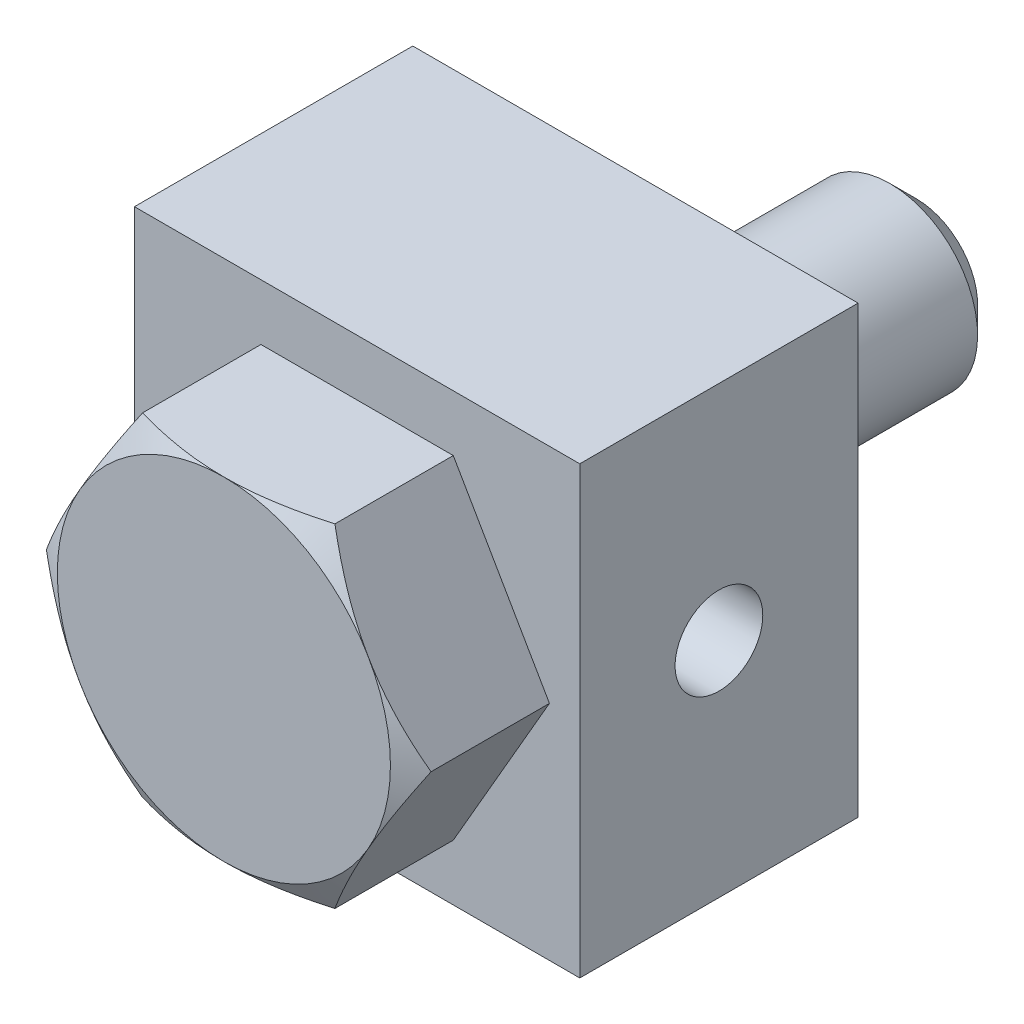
ISO-10303-21;
HEADER;
FILE_DESCRIPTION(('STEP AP214'),'2;1');
FILE_NAME('part.step','',(''),(''),'','','');
FILE_SCHEMA(('AUTOMOTIVE_DESIGN { 1 0 10303 214 1 1 1 1 }'));
ENDSEC;
DATA;
#1=APPLICATION_CONTEXT('core data for automotive mechanical design processes');
#2=APPLICATION_PROTOCOL_DEFINITION('international standard','automotive_design',2000,#1);
#3=PRODUCT_CONTEXT('',#1,'mechanical');
#4=PRODUCT('Part','Part','',(#3));
#5=PRODUCT_RELATED_PRODUCT_CATEGORY('part','',(#4));
#6=PRODUCT_DEFINITION_FORMATION('','',#4);
#7=PRODUCT_DEFINITION_CONTEXT('part definition',#1,'design');
#8=PRODUCT_DEFINITION('design','',#6,#7);
#9=PRODUCT_DEFINITION_SHAPE('','',#8);
#10=(LENGTH_UNIT() NAMED_UNIT(*) SI_UNIT(.MILLI.,.METRE.));
#11=(NAMED_UNIT(*) PLANE_ANGLE_UNIT() SI_UNIT($,.RADIAN.));
#12=(NAMED_UNIT(*) SI_UNIT($,.STERADIAN.) SOLID_ANGLE_UNIT());
#13=UNCERTAINTY_MEASURE_WITH_UNIT(LENGTH_MEASURE(1.E-05),#10,'distance_accuracy_value','');
#14=(GEOMETRIC_REPRESENTATION_CONTEXT(3) GLOBAL_UNCERTAINTY_ASSIGNED_CONTEXT((#13)) GLOBAL_UNIT_ASSIGNED_CONTEXT((#10,
#11,#12)) REPRESENTATION_CONTEXT('',''));
#15=CARTESIAN_POINT('',(0.,0.,0.));
#16=DIRECTION('',(0.,0.,1.));
#17=DIRECTION('',(1.,0.,0.));
#18=AXIS2_PLACEMENT_3D('',#15,#16,#17);
#19=CARTESIAN_POINT('',(12.7,12.7,16.891));
#20=DIRECTION('',(0.,0.,-1.));
#21=DIRECTION('',(0.,-1.,0.));
#22=AXIS2_PLACEMENT_3D('',#19,#20,#21);
#23=PLANE('',#22);
#24=DIRECTION('',(-1.,0.,0.));
#25=VECTOR('',#24,1.);
#26=CARTESIAN_POINT('',(0.,12.7,16.891));
#27=LINE('',#26,#25);
#28=CARTESIAN_POINT('',(12.7,12.7,16.891));
#29=VERTEX_POINT('',#28);
#30=CARTESIAN_POINT('',(-12.7,12.7,16.891));
#31=VERTEX_POINT('',#30);
#32=EDGE_CURVE('E259',#29,#31,#27,.T.);
#33=ORIENTED_EDGE('',*,*,#32,.T.);
#34=DIRECTION('',(0.,1.,0.));
#35=VECTOR('',#34,1.);
#36=CARTESIAN_POINT('',(-12.7,0.,16.891));
#37=LINE('',#36,#35);
#38=CARTESIAN_POINT('',(-12.7,-12.7,16.891));
#39=VERTEX_POINT('',#38);
#40=EDGE_CURVE('E268',#39,#31,#37,.T.);
#41=ORIENTED_EDGE('',*,*,#40,.F.);
#42=DIRECTION('',(-1.,0.,0.));
#43=VECTOR('',#42,1.);
#44=CARTESIAN_POINT('',(0.,-12.7,16.891));
#45=LINE('',#44,#43);
#46=CARTESIAN_POINT('',(12.7,-12.7,16.891));
#47=VERTEX_POINT('',#46);
#48=EDGE_CURVE('E313',#47,#39,#45,.T.);
#49=ORIENTED_EDGE('',*,*,#48,.F.);
#50=DIRECTION('',(0.,1.,0.));
#51=VECTOR('',#50,1.);
#52=CARTESIAN_POINT('',(12.7,0.,16.891));
#53=LINE('',#52,#51);
#54=EDGE_CURVE('E280',#47,#29,#53,.T.);
#55=ORIENTED_EDGE('',*,*,#54,.T.);
#56=EDGE_LOOP('',(#33,#41,#49,#55));
#57=FACE_BOUND('',#56,.T.);
#58=DIRECTION('',(-0.5,-0.866025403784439,0.));
#59=VECTOR('',#58,1.);
#60=CARTESIAN_POINT('',(-5.4848275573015,9.5,16.891));
#61=LINE('',#60,#59);
#62=CARTESIAN_POINT('',(-5.4848275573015,9.5,16.891));
#63=VERTEX_POINT('',#62);
#64=CARTESIAN_POINT('',(-10.969655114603,0.,16.891));
#65=VERTEX_POINT('',#64);
#66=EDGE_CURVE('E503',#63,#65,#61,.T.);
#67=ORIENTED_EDGE('',*,*,#66,.F.);
#68=DIRECTION('',(-1.,0.,0.));
#69=VECTOR('',#68,1.);
#70=CARTESIAN_POINT('',(5.48482755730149,9.5,16.891));
#71=LINE('',#70,#69);
#72=CARTESIAN_POINT('',(5.48482755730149,9.5,16.891));
#73=VERTEX_POINT('',#72);
#74=EDGE_CURVE('E517',#73,#63,#71,.T.);
#75=ORIENTED_EDGE('',*,*,#74,.F.);
#76=DIRECTION('',(-0.5,0.866025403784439,0.));
#77=VECTOR('',#76,1.);
#78=CARTESIAN_POINT('',(10.969655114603,0.,16.891));
#79=LINE('',#78,#77);
#80=CARTESIAN_POINT('',(10.969655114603,0.,16.891));
#81=VERTEX_POINT('',#80);
#82=EDGE_CURVE('E514',#81,#73,#79,.T.);
#83=ORIENTED_EDGE('',*,*,#82,.F.);
#84=DIRECTION('',(0.5,0.866025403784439,0.));
#85=VECTOR('',#84,1.);
#86=CARTESIAN_POINT('',(5.4848275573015,-9.5,16.891));
#87=LINE('',#86,#85);
#88=CARTESIAN_POINT('',(5.48482755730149,-9.5,16.891));
#89=VERTEX_POINT('',#88);
#90=EDGE_CURVE('E512',#89,#81,#87,.T.);
#91=ORIENTED_EDGE('',*,*,#90,.F.);
#92=DIRECTION('',(1.,0.,0.));
#93=VECTOR('',#92,1.);
#94=CARTESIAN_POINT('',(-5.48482755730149,-9.5,16.891));
#95=LINE('',#94,#93);
#96=CARTESIAN_POINT('',(-5.48482755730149,-9.5,16.891));
#97=VERTEX_POINT('',#96);
#98=EDGE_CURVE('E509',#97,#89,#95,.T.);
#99=ORIENTED_EDGE('',*,*,#98,.F.);
#100=DIRECTION('',(0.5,-0.866025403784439,0.));
#101=VECTOR('',#100,1.);
#102=CARTESIAN_POINT('',(-10.969655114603,0.,16.891));
#103=LINE('',#102,#101);
#104=EDGE_CURVE('E506',#65,#97,#103,.T.);
#105=ORIENTED_EDGE('',*,*,#104,.F.);
#106=EDGE_LOOP('',(#67,#75,#83,#91,#99,#105));
#107=FACE_BOUND('',#106,.T.);
#108=ADVANCED_FACE('F14',(#57,#107),#23,.F.);
#109=CARTESIAN_POINT('',(6.3747904,-6.3747904,0.));
#110=DIRECTION('',(0.,0.,1.));
#111=DIRECTION('',(0.,1.,0.));
#112=AXIS2_PLACEMENT_3D('',#109,#110,#111);
#113=PLANE('',#112);
#114=CARTESIAN_POINT('',(0.,0.,0.));
#115=DIRECTION('',(0.,0.,1.));
#116=DIRECTION('',(0.,1.,0.));
#117=AXIS2_PLACEMENT_3D('',#114,#115,#116);
#118=CIRCLE('',#117,4.99999);
#119=CARTESIAN_POINT('',(0.,4.99999,0.));
#120=VERTEX_POINT('',#119);
#121=EDGE_CURVE('E134',#120,#120,#118,.T.);
#122=ORIENTED_EDGE('',*,*,#121,.T.);
#123=EDGE_LOOP('',(#122));
#124=FACE_BOUND('',#123,.T.);
#125=CARTESIAN_POINT('',(0.,0.,0.));
#126=DIRECTION('',(0.,0.,1.));
#127=DIRECTION('',(1.,0.,0.));
#128=AXIS2_PLACEMENT_3D('',#125,#126,#127);
#129=CIRCLE('',#128,6.2992);
#130=CARTESIAN_POINT('',(6.2992,0.,0.));
#131=VERTEX_POINT('',#130);
#132=EDGE_CURVE('E302',#131,#131,#129,.F.);
#133=ORIENTED_EDGE('',*,*,#132,.T.);
#134=EDGE_LOOP('',(#133));
#135=FACE_BOUND('',#134,.T.);
#136=ADVANCED_FACE('F212',(#124,#135),#113,.F.);
#137=CARTESIAN_POINT('',(-12.7,-12.7,1.016));
#138=DIRECTION('',(1.,0.,0.));
#139=DIRECTION('',(0.,1.,0.));
#140=AXIS2_PLACEMENT_3D('',#137,#138,#139);
#141=PLANE('',#140);
#142=CARTESIAN_POINT('',(-12.7,0.,8.9535));
#143=DIRECTION('',(1.,0.,0.));
#144=DIRECTION('',(0.,0.,-1.));
#145=AXIS2_PLACEMENT_3D('',#142,#143,#144);
#146=CIRCLE('',#145,2.5);
#147=CARTESIAN_POINT('',(-12.7,0.,6.4535));
#148=VERTEX_POINT('',#147);
#149=EDGE_CURVE('E331',#148,#148,#146,.T.);
#150=ORIENTED_EDGE('',*,*,#149,.T.);
#151=EDGE_LOOP('',(#150));
#152=FACE_BOUND('',#151,.T.);
#153=DIRECTION('',(0.,0.,1.));
#154=VECTOR('',#153,1.);
#155=CARTESIAN_POINT('',(-12.7,-12.7,8.9535));
#156=LINE('',#155,#154);
#157=CARTESIAN_POINT('',(-12.7,-12.7,1.016));
#158=VERTEX_POINT('',#157);
#159=EDGE_CURVE('E305',#158,#39,#156,.T.);
#160=ORIENTED_EDGE('',*,*,#159,.T.);
#161=ORIENTED_EDGE('',*,*,#40,.T.);
#162=DIRECTION('',(0.,0.,-1.));
#163=VECTOR('',#162,1.);
#164=CARTESIAN_POINT('',(-12.7,12.7,8.9535));
#165=LINE('',#164,#163);
#166=CARTESIAN_POINT('',(-12.7,12.7,1.016));
#167=VERTEX_POINT('',#166);
#168=EDGE_CURVE('E258',#31,#167,#165,.T.);
#169=ORIENTED_EDGE('',*,*,#168,.T.);
#170=DIRECTION('',(0.,1.,0.));
#171=VECTOR('',#170,1.);
#172=CARTESIAN_POINT('',(-12.7,0.,1.016));
#173=LINE('',#172,#171);
#174=EDGE_CURVE('E271',#158,#167,#173,.T.);
#175=ORIENTED_EDGE('',*,*,#174,.F.);
#176=EDGE_LOOP('',(#160,#161,#169,#175));
#177=FACE_BOUND('',#176,.T.);
#178=ADVANCED_FACE('F220',(#152,#177),#141,.F.);
#179=CARTESIAN_POINT('',(0.,0.,0.));
#180=DIRECTION('',(0.,0.,1.));
#181=DIRECTION('',(1.,0.,0.));
#182=AXIS2_PLACEMENT_3D('',#179,#180,#181);
#183=CYLINDRICAL_SURFACE('',#182,6.2992);
#184=CARTESIAN_POINT('',(0.,0.,1.016));
#185=DIRECTION('',(0.,0.,1.));
#186=DIRECTION('',(1.,0.,0.));
#187=AXIS2_PLACEMENT_3D('',#184,#185,#186);
#188=CIRCLE('',#187,6.2992);
#189=CARTESIAN_POINT('',(6.2992,0.,1.016));
#190=VERTEX_POINT('',#189);
#191=EDGE_CURVE('E277',#190,#190,#188,.T.);
#192=ORIENTED_EDGE('',*,*,#191,.F.);
#193=EDGE_LOOP('',(#192));
#194=FACE_BOUND('',#193,.T.);
#195=ORIENTED_EDGE('',*,*,#132,.F.);
#196=EDGE_LOOP('',(#195));
#197=FACE_BOUND('',#196,.T.);
#198=ADVANCED_FACE('F253',(#194,#197),#183,.T.);
#199=CARTESIAN_POINT('',(12.7,-12.7,1.016));
#200=DIRECTION('',(0.,1.,0.));
#201=DIRECTION('',(-1.,0.,0.));
#202=AXIS2_PLACEMENT_3D('',#199,#200,#201);
#203=PLANE('',#202);
#204=DIRECTION('',(0.,0.,1.));
#205=VECTOR('',#204,1.);
#206=CARTESIAN_POINT('',(12.7,-12.7,8.9535));
#207=LINE('',#206,#205);
#208=CARTESIAN_POINT('',(12.7,-12.7,1.016));
#209=VERTEX_POINT('',#208);
#210=EDGE_CURVE('E278',#209,#47,#207,.T.);
#211=ORIENTED_EDGE('',*,*,#210,.T.);
#212=ORIENTED_EDGE('',*,*,#48,.T.);
#213=ORIENTED_EDGE('',*,*,#159,.F.);
#214=DIRECTION('',(-1.,0.,0.));
#215=VECTOR('',#214,1.);
#216=CARTESIAN_POINT('',(0.,-12.7,1.016));
#217=LINE('',#216,#215);
#218=EDGE_CURVE('E266',#209,#158,#217,.T.);
#219=ORIENTED_EDGE('',*,*,#218,.F.);
#220=EDGE_LOOP('',(#211,#212,#213,#219));
#221=FACE_BOUND('',#220,.T.);
#222=ADVANCED_FACE('F247',(#221),#203,.F.);
#223=CARTESIAN_POINT('',(-12.7,12.7,1.016));
#224=DIRECTION('',(0.,-1.,0.));
#225=DIRECTION('',(1.,0.,0.));
#226=AXIS2_PLACEMENT_3D('',#223,#224,#225);
#227=PLANE('',#226);
#228=ORIENTED_EDGE('',*,*,#168,.F.);
#229=ORIENTED_EDGE('',*,*,#32,.F.);
#230=DIRECTION('',(0.,0.,-1.));
#231=VECTOR('',#230,1.);
#232=CARTESIAN_POINT('',(12.7,12.7,8.9535));
#233=LINE('',#232,#231);
#234=CARTESIAN_POINT('',(12.7,12.7,1.016));
#235=VERTEX_POINT('',#234);
#236=EDGE_CURVE('E282',#29,#235,#233,.T.);
#237=ORIENTED_EDGE('',*,*,#236,.T.);
#238=DIRECTION('',(1.,0.,0.));
#239=VECTOR('',#238,1.);
#240=CARTESIAN_POINT('',(0.,12.7,1.016));
#241=LINE('',#240,#239);
#242=EDGE_CURVE('E262',#167,#235,#241,.T.);
#243=ORIENTED_EDGE('',*,*,#242,.F.);
#244=EDGE_LOOP('',(#228,#229,#237,#243));
#245=FACE_BOUND('',#244,.T.);
#246=ADVANCED_FACE('F240',(#245),#227,.F.);
#247=CARTESIAN_POINT('',(12.7,12.7,1.016));
#248=DIRECTION('',(0.,0.,-1.));
#249=DIRECTION('',(0.,-1.,0.));
#250=AXIS2_PLACEMENT_3D('',#247,#248,#249);
#251=PLANE('',#250);
#252=ORIENTED_EDGE('',*,*,#191,.T.);
#253=EDGE_LOOP('',(#252));
#254=FACE_BOUND('',#253,.T.);
#255=ORIENTED_EDGE('',*,*,#174,.T.);
#256=ORIENTED_EDGE('',*,*,#242,.T.);
#257=DIRECTION('',(0.,-1.,0.));
#258=VECTOR('',#257,1.);
#259=CARTESIAN_POINT('',(12.7,0.,1.016));
#260=LINE('',#259,#258);
#261=EDGE_CURVE('E284',#235,#209,#260,.T.);
#262=ORIENTED_EDGE('',*,*,#261,.T.);
#263=ORIENTED_EDGE('',*,*,#218,.T.);
#264=EDGE_LOOP('',(#255,#256,#262,#263));
#265=FACE_BOUND('',#264,.T.);
#266=ADVANCED_FACE('F229',(#254,#265),#251,.T.);
#267=CARTESIAN_POINT('',(12.7,12.7,1.016));
#268=DIRECTION('',(-1.,0.,0.));
#269=DIRECTION('',(0.,-1.,0.));
#270=AXIS2_PLACEMENT_3D('',#267,#268,#269);
#271=PLANE('',#270);
#272=CARTESIAN_POINT('',(12.7,0.,8.9535));
#273=DIRECTION('',(1.,0.,0.));
#274=DIRECTION('',(0.,0.,-1.));
#275=AXIS2_PLACEMENT_3D('',#272,#273,#274);
#276=CIRCLE('',#275,2.5);
#277=CARTESIAN_POINT('',(12.7,0.,6.4535));
#278=VERTEX_POINT('',#277);
#279=EDGE_CURVE('E334',#278,#278,#276,.T.);
#280=ORIENTED_EDGE('',*,*,#279,.F.);
#281=EDGE_LOOP('',(#280));
#282=FACE_BOUND('',#281,.T.);
#283=ORIENTED_EDGE('',*,*,#236,.F.);
#284=ORIENTED_EDGE('',*,*,#54,.F.);
#285=ORIENTED_EDGE('',*,*,#210,.F.);
#286=ORIENTED_EDGE('',*,*,#261,.F.);
#287=EDGE_LOOP('',(#283,#284,#285,#286));
#288=FACE_BOUND('',#287,.T.);
#289=ADVANCED_FACE('F215',(#282,#288),#271,.F.);
#290=CARTESIAN_POINT('',(0.,0.,-13.716));
#291=DIRECTION('',(0.,0.,1.));
#292=DIRECTION('',(1.,0.,0.));
#293=AXIS2_PLACEMENT_3D('',#290,#291,#292);
#294=CYLINDRICAL_SURFACE('',#293,4.99999);
#295=CARTESIAN_POINT('',(0.,0.,-13.5));
#296=DIRECTION('',(0.,0.,-1.));
#297=DIRECTION('',(0.,1.,0.));
#298=AXIS2_PLACEMENT_3D('',#295,#296,#297);
#299=CIRCLE('',#298,4.99999);
#300=CARTESIAN_POINT('',(0.,4.99999,-13.5));
#301=VERTEX_POINT('',#300);
#302=EDGE_CURVE('E9',#301,#301,#299,.F.);
#303=ORIENTED_EDGE('',*,*,#302,.T.);
#304=EDGE_LOOP('',(#303));
#305=FACE_BOUND('',#304,.T.);
#306=ORIENTED_EDGE('',*,*,#121,.F.);
#307=EDGE_LOOP('',(#306));
#308=FACE_BOUND('',#307,.T.);
#309=ADVANCED_FACE('F223',(#305,#308),#294,.T.);
#310=CARTESIAN_POINT('',(-5.4848275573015,9.5,24.491));
#311=DIRECTION('',(0.866025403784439,-0.5,0.));
#312=DIRECTION('',(0.5,0.866025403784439,0.));
#313=AXIS2_PLACEMENT_3D('',#310,#311,#312);
#314=PLANE('',#313);
#315=DIRECTION('',(0.,0.,-1.));
#316=VECTOR('',#315,1.);
#317=CARTESIAN_POINT('',(-10.969655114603,0.,24.491));
#318=LINE('',#317,#316);
#319=CARTESIAN_POINT('',(-10.969655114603,0.,23.6424942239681));
#320=VERTEX_POINT('',#319);
#321=EDGE_CURVE('E286',#320,#65,#318,.T.);
#322=ORIENTED_EDGE('',*,*,#321,.F.);
#323=CARTESIAN_POINT('',(-10.9697705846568,-0.000200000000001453,23.6424275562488));
#324=CARTESIAN_POINT('',(-10.8492020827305,0.208630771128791,23.7120265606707));
#325=CARTESIAN_POINT('',(-10.7281840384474,0.418240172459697,23.7784666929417));
#326=CARTESIAN_POINT('',(-10.4851774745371,0.839139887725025,23.9041527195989));
#327=CARTESIAN_POINT('',(-10.3631886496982,1.05043073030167,23.9633962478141));
#328=CARTESIAN_POINT('',(-9.995256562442,1.68770779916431,24.1291854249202));
#329=CARTESIAN_POINT('',(-9.74786083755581,2.11620976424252,24.2234855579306));
#330=CARTESIAN_POINT('',(-9.37764446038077,2.75744333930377,24.3340612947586));
#331=CARTESIAN_POINT('',(-9.25592985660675,2.96825921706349,24.3655601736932));
#332=CARTESIAN_POINT('',(-9.01193711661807,3.39086703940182,24.418381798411));
#333=CARTESIAN_POINT('',(-8.88965896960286,3.60265900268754,24.4397043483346));
#334=CARTESIAN_POINT('',(-8.6448987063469,4.0265962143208,24.4716269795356));
#335=CARTESIAN_POINT('',(-8.5224170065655,4.23874074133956,24.4822398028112));
#336=CARTESIAN_POINT('',(-8.27734047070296,4.6632257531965,24.492517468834));
#337=CARTESIAN_POINT('',(-8.1547456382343,4.87556623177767,24.4921826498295));
#338=CARTESIAN_POINT('',(-7.92555157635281,5.27254199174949,24.4813266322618));
#339=CARTESIAN_POINT('',(-7.81893617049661,5.45720529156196,24.4721297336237));
#340=CARTESIAN_POINT('',(-7.60595470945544,5.82610000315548,24.4456346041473));
#341=CARTESIAN_POINT('',(-7.49958867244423,6.01033138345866,24.4283358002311));
#342=CARTESIAN_POINT('',(-7.1809027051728,6.56231167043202,24.3646955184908));
#343=CARTESIAN_POINT('',(-6.96914687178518,6.92908353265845,24.3066180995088));
#344=CARTESIAN_POINT('',(-6.54338898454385,7.66651782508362,24.1614239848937));
#345=CARTESIAN_POINT('',(-6.329441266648,8.03708614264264,24.0736918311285));
#346=CARTESIAN_POINT('',(-5.90473630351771,8.77269671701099,23.8745762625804));
#347=CARTESIAN_POINT('',(-5.69397361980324,9.13774839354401,23.7632396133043));
#348=CARTESIAN_POINT('',(-5.48471208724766,9.5002,23.6424275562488));
#349=B_SPLINE_CURVE_WITH_KNOTS('',3,(#323,#324,#325,#326,#327,#328,#329,#330,#331,#332,#333,
#334,#335,#336,#337,#338,#339,#340,#341,#342,#343,#344,#345,#346,#347,#348),.UNSPECIFIED.,.F.,
.F.,(4,2,2,2,2,2,2,2,2,2,2,2,4),(0.,0.752880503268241,1.50600787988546,3.01546870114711,
3.7516733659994,4.48789219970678,5.2232340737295,5.95855322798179,6.59868084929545,
7.23885375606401,8.52010929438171,9.82978009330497,11.1368800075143),.UNSPECIFIED.);
#350=CARTESIAN_POINT('',(-8.22724133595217,4.75,24.491));
#351=VERTEX_POINT('',#350);
#352=EDGE_CURVE('E144',#320,#351,#349,.T.);
#353=ORIENTED_EDGE('',*,*,#352,.T.);
#354=CARTESIAN_POINT('',(-5.4848275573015,9.5,23.6424942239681));
#355=VERTEX_POINT('',#354);
#356=EDGE_CURVE('E154',#351,#355,#349,.T.);
#357=ORIENTED_EDGE('',*,*,#356,.T.);
#358=DIRECTION('',(0.,0.,-1.));
#359=VECTOR('',#358,1.);
#360=CARTESIAN_POINT('',(-5.4848275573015,9.5,24.491));
#361=LINE('',#360,#359);
#362=EDGE_CURVE('E520',#355,#63,#361,.T.);
#363=ORIENTED_EDGE('',*,*,#362,.T.);
#364=ORIENTED_EDGE('',*,*,#66,.T.);
#365=EDGE_LOOP('',(#322,#353,#357,#363,#364));
#366=FACE_BOUND('',#365,.T.);
#367=ADVANCED_FACE('F237',(#366),#314,.F.);
#368=CARTESIAN_POINT('',(-10.969655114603,0.,24.491));
#369=DIRECTION('',(0.866025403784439,0.5,0.));
#370=DIRECTION('',(-0.5,0.866025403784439,0.));
#371=AXIS2_PLACEMENT_3D('',#368,#369,#370);
#372=PLANE('',#371);
#373=DIRECTION('',(0.,0.,-1.));
#374=VECTOR('',#373,1.);
#375=CARTESIAN_POINT('',(-5.48482755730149,-9.5,24.491));
#376=LINE('',#375,#374);
#377=CARTESIAN_POINT('',(-5.48482755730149,-9.5,23.6424942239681));
#378=VERTEX_POINT('',#377);
#379=EDGE_CURVE('E526',#378,#97,#376,.T.);
#380=ORIENTED_EDGE('',*,*,#379,.F.);
#381=CARTESIAN_POINT('',(-5.48471208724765,-9.5002,23.6424275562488));
#382=CARTESIAN_POINT('',(-5.60528058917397,-9.29136922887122,23.7120265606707));
#383=CARTESIAN_POINT('',(-5.72629863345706,-9.08175982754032,23.7784666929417));
#384=CARTESIAN_POINT('',(-5.96930519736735,-8.660860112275,23.9041527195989));
#385=CARTESIAN_POINT('',(-6.09129402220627,-8.44956926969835,23.9633962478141));
#386=CARTESIAN_POINT('',(-6.45922610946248,-7.81229220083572,24.1291854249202));
#387=CARTESIAN_POINT('',(-6.70662183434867,-7.38379023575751,24.2234855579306));
#388=CARTESIAN_POINT('',(-7.07683821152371,-6.74255666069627,24.3340612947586));
#389=CARTESIAN_POINT('',(-7.19855281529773,-6.53174078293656,24.3655601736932));
#390=CARTESIAN_POINT('',(-7.4425455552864,-6.10913296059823,24.418381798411));
#391=CARTESIAN_POINT('',(-7.56482370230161,-5.89734099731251,24.4397043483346));
#392=CARTESIAN_POINT('',(-7.80958396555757,-5.47340378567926,24.4716269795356));
#393=CARTESIAN_POINT('',(-7.93206566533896,-5.26125925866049,24.4822398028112));
#394=CARTESIAN_POINT('',(-8.17714220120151,-4.83677424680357,24.492517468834));
#395=CARTESIAN_POINT('',(-8.29973703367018,-4.6244337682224,24.4921826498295));
#396=CARTESIAN_POINT('',(-8.52893109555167,-4.22745800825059,24.4813266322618));
#397=CARTESIAN_POINT('',(-8.63554650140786,-4.04279470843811,24.4721297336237));
#398=CARTESIAN_POINT('',(-8.84852796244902,-3.67389999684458,24.4456346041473));
#399=CARTESIAN_POINT('',(-8.95489399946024,-3.4896686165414,24.428335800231));
#400=CARTESIAN_POINT('',(-9.27357996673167,-2.93768832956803,24.3646955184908));
#401=CARTESIAN_POINT('',(-9.48533580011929,-2.5709164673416,24.3066180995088));
#402=CARTESIAN_POINT('',(-9.91109368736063,-1.83348217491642,24.1614239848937));
#403=CARTESIAN_POINT('',(-10.1250414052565,-1.4629138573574,24.0736918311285));
#404=CARTESIAN_POINT('',(-10.5497463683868,-0.72730328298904,23.8745762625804));
#405=CARTESIAN_POINT('',(-10.7605090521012,-0.36225160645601,23.7632396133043));
#406=CARTESIAN_POINT('',(-10.9697705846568,0.000199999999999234,23.6424275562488));
#407=B_SPLINE_CURVE_WITH_KNOTS('',3,(#381,#382,#383,#384,#385,#386,#387,#388,#389,#390,#391,
#392,#393,#394,#395,#396,#397,#398,#399,#400,#401,#402,#403,#404,#405,#406),.UNSPECIFIED.,.F.,
.F.,(4,2,2,2,2,2,2,2,2,2,2,2,4),(0.,0.752880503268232,1.50600787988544,3.01546870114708,
3.75167336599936,4.48789219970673,5.22323407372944,5.95855322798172,6.59868084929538,
7.23885375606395,8.52010929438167,9.82978009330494,11.1368800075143),.UNSPECIFIED.);
#408=CARTESIAN_POINT('',(-8.22724133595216,-4.75,24.491));
#409=VERTEX_POINT('',#408);
#410=EDGE_CURVE('E120',#378,#409,#407,.T.);
#411=ORIENTED_EDGE('',*,*,#410,.T.);
#412=EDGE_CURVE('E37',#409,#320,#407,.T.);
#413=ORIENTED_EDGE('',*,*,#412,.T.);
#414=ORIENTED_EDGE('',*,*,#321,.T.);
#415=ORIENTED_EDGE('',*,*,#104,.T.);
#416=EDGE_LOOP('',(#380,#411,#413,#414,#415));
#417=FACE_BOUND('',#416,.T.);
#418=ADVANCED_FACE('F464',(#417),#372,.F.);
#419=CARTESIAN_POINT('',(-5.48482755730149,-9.5,24.491));
#420=DIRECTION('',(0.,1.,0.));
#421=DIRECTION('',(0.,0.,1.));
#422=AXIS2_PLACEMENT_3D('',#419,#420,#421);
#423=PLANE('',#422);
#424=DIRECTION('',(0.,0.,-1.));
#425=VECTOR('',#424,1.);
#426=CARTESIAN_POINT('',(5.4848275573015,-9.5,24.491));
#427=LINE('',#426,#425);
#428=CARTESIAN_POINT('',(5.4848275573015,-9.5,23.6424942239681));
#429=VERTEX_POINT('',#428);
#430=EDGE_CURVE('E525',#429,#89,#427,.T.);
#431=ORIENTED_EDGE('',*,*,#430,.F.);
#432=CARTESIAN_POINT('',(-14.7524780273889,-9.5,19.8452532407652));
#433=CARTESIAN_POINT('',(-14.5449439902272,-9.5,19.9459905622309));
#434=CARTESIAN_POINT('',(-14.3371669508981,-9.5,20.0462270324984));
#435=CARTESIAN_POINT('',(-13.9210761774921,-9.5,20.2455848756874));
#436=CARTESIAN_POINT('',(-13.7127624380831,-9.5,20.3447062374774));
#437=CARTESIAN_POINT('',(-13.0868849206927,-9.5,20.6402535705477));
#438=CARTESIAN_POINT('',(-12.6684459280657,-9.5,20.8348330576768));
#439=CARTESIAN_POINT('',(-11.82650642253,-9.5,21.2189386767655));
#440=CARTESIAN_POINT('',(-11.4029907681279,-9.5,21.4084316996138));
#441=CARTESIAN_POINT('',(-10.5525986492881,-9.5,21.7796924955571));
#442=CARTESIAN_POINT('',(-10.1257223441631,-9.5,21.9614606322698));
#443=CARTESIAN_POINT('',(-9.25405557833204,-9.5,22.3209497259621));
#444=CARTESIAN_POINT('',(-8.809132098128,-9.5,22.4983499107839));
#445=CARTESIAN_POINT('',(-7.91408812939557,-9.5,22.8397715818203));
#446=CARTESIAN_POINT('',(-7.46396706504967,-9.5,23.0037915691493));
#447=CARTESIAN_POINT('',(-6.55864256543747,-9.5,23.3141604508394));
#448=CARTESIAN_POINT('',(-6.1034514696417,-9.5,23.460544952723));
#449=CARTESIAN_POINT('',(-5.18655588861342,-9.5,23.7309603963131));
#450=CARTESIAN_POINT('',(-4.7248534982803,-9.5,23.854998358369));
#451=CARTESIAN_POINT('',(-3.79717375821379,-9.5,24.0741093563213));
#452=CARTESIAN_POINT('',(-3.33123486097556,-9.5,24.1693408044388));
#453=CARTESIAN_POINT('',(-2.62806774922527,-9.5,24.2864727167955));
#454=CARTESIAN_POINT('',(-2.39295175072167,-9.5,24.3212323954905));
#455=CARTESIAN_POINT('',(-1.92154445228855,-9.5,24.3814986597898));
#456=CARTESIAN_POINT('',(-1.68525326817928,-9.5,24.4070061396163));
#457=CARTESIAN_POINT('',(-1.21490723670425,-9.5,24.4479389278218));
#458=CARTESIAN_POINT('',(-0.980863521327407,-9.5,24.4634916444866));
#459=CARTESIAN_POINT('',(-0.512328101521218,-9.5,24.4846849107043));
#460=CARTESIAN_POINT('',(-0.277836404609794,-9.5,24.4903256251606));
#461=CARTESIAN_POINT('',(0.191175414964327,-9.5,24.4915602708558));
#462=CARTESIAN_POINT('',(0.425695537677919,-9.5,24.487154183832));
#463=CARTESIAN_POINT('',(0.894341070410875,-9.5,24.4684031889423));
#464=CARTESIAN_POINT('',(1.12846646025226,-9.5,24.4540577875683));
#465=CARTESIAN_POINT('',(1.69056071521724,-9.5,24.4079894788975));
#466=CARTESIAN_POINT('',(2.01815386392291,-9.5,24.3715828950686));
#467=CARTESIAN_POINT('',(2.6709061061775,-9.5,24.281292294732));
#468=CARTESIAN_POINT('',(2.99606486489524,-9.5,24.2274059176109));
#469=CARTESIAN_POINT('',(3.967520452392,-9.5,24.0423846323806));
#470=CARTESIAN_POINT('',(4.60943284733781,-9.5,23.8879213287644));
#471=CARTESIAN_POINT('',(5.56925757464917,-9.5,23.6201011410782));
#472=CARTESIAN_POINT('',(5.89214970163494,-9.5,23.5235647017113));
#473=CARTESIAN_POINT('',(6.53479798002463,-9.5,23.3204713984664));
#474=CARTESIAN_POINT('',(6.85455411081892,-9.5,23.2139144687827));
#475=CARTESIAN_POINT('',(7.49103073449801,-9.5,22.992489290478));
#476=CARTESIAN_POINT('',(7.80775219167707,-9.5,22.8776237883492));
#477=CARTESIAN_POINT('',(8.43857175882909,-9.5,22.6409323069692));
#478=CARTESIAN_POINT('',(8.75266989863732,-9.5,22.5191064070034));
#479=CARTESIAN_POINT('',(9.49009378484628,-9.5,22.2251837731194));
#480=CARTESIAN_POINT('',(9.91244509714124,-9.5,22.0506469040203));
#481=CARTESIAN_POINT('',(10.7535764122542,-9.5,21.693145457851));
#482=CARTESIAN_POINT('',(11.1723561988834,-9.5,21.5101803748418));
#483=CARTESIAN_POINT('',(12.0070039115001,-9.5,21.1374989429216));
#484=CARTESIAN_POINT('',(12.4228711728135,-9.5,20.9477811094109));
#485=CARTESIAN_POINT('',(13.252083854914,-9.5,20.5629474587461));
#486=CARTESIAN_POINT('',(13.6654293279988,-9.5,20.3678317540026));
#487=CARTESIAN_POINT('',(14.4904611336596,-9.5,19.972991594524));
#488=CARTESIAN_POINT('',(14.9021451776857,-9.5,19.7732623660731));
#489=CARTESIAN_POINT('',(15.7237369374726,-9.5,19.3701839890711));
#490=CARTESIAN_POINT('',(16.1336446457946,-9.5,19.1668348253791));
#491=CARTESIAN_POINT('',(16.9519029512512,-9.5,18.757159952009));
#492=CARTESIAN_POINT('',(17.3602537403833,-9.5,18.5508346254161));
#493=CARTESIAN_POINT('',(18.1756742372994,-9.5,18.1356664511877));
#494=CARTESIAN_POINT('',(18.5827439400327,-9.5,17.9268235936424));
#495=CARTESIAN_POINT('',(19.7346259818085,-9.5,17.3320693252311));
#496=CARTESIAN_POINT('',(20.4781477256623,-9.5,16.9436584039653));
#497=CARTESIAN_POINT('',(21.9624121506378,-9.5,16.1615126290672));
#498=CARTESIAN_POINT('',(22.7031547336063,-9.5,15.7677775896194));
#499=CARTESIAN_POINT('',(24.1806235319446,-9.5,14.9772078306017));
#500=CARTESIAN_POINT('',(24.917355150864,-9.5,14.5803832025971));
#501=CARTESIAN_POINT('',(26.0211396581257,-9.5,13.9827721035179));
#502=CARTESIAN_POINT('',(26.3888391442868,-9.5,13.7831781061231));
#503=CARTESIAN_POINT('',(27.1238498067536,-9.5,13.3832777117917));
#504=CARTESIAN_POINT('',(27.4911609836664,-9.5,13.1829713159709));
#505=CARTESIAN_POINT('',(27.8582999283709,-9.5,12.9823496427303));
#506=B_SPLINE_CURVE_WITH_KNOTS('',3,(#432,#433,#434,#435,#436,#437,#438,#439,#440,#441,#442,
#443,#444,#445,#446,#447,#448,#449,#450,#451,#452,#453,#454,#455,#456,#457,#458,#459,#460,#461,
#462,#463,#464,#465,#466,#467,#468,#469,#470,#471,#472,#473,#474,#475,#476,#477,#478,#479,#480,
#481,#482,#483,#484,#485,#486,#487,#488,#489,#490,#491,#492,#493,#494,#495,#496,#497,#498,#499,
#500,#501,#502,#503,#504,#505),.UNSPECIFIED.,.F.,.F.,(4,2,2,2,2,2,2,2,2,2,2,2,2,2,2,2,2,2,2,2,2,
2,2,2,2,2,2,2,2,2,2,2,2,2,2,2,4),(0.,0.692072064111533,1.38415103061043,2.76851276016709,
4.16037848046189,5.55217861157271,6.9889701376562,8.42592239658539,9.85992289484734,
11.2934721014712,12.7189883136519,13.4318495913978,14.1446419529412,14.8481187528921,
15.5515838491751,16.2550502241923,16.9585515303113,17.9468232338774,18.9352284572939,
20.9131299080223,21.9240882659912,22.9350532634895,23.9456855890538,24.9563064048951,
26.3271662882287,27.698108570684,29.0693541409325,30.440571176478,31.8132769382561,
33.185988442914,34.5585248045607,35.9310665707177,38.4476166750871,40.9642548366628,
43.4746603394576,44.7297956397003,45.984928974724),.UNSPECIFIED.);
#507=CARTESIAN_POINT('',(0.,-9.5,24.491));
#508=VERTEX_POINT('',#507);
#509=EDGE_CURVE('E116',#429,#508,#506,.F.);
#510=ORIENTED_EDGE('',*,*,#509,.T.);
#511=EDGE_CURVE('E29',#508,#378,#506,.F.);
#512=ORIENTED_EDGE('',*,*,#511,.T.);
#513=ORIENTED_EDGE('',*,*,#379,.T.);
#514=ORIENTED_EDGE('',*,*,#98,.T.);
#515=EDGE_LOOP('',(#431,#510,#512,#513,#514));
#516=FACE_BOUND('',#515,.T.);
#517=ADVANCED_FACE('F471',(#516),#423,.F.);
#518=CARTESIAN_POINT('',(5.4848275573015,-9.5,24.491));
#519=DIRECTION('',(-0.866025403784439,0.5,0.));
#520=DIRECTION('',(-0.5,-0.866025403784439,0.));
#521=AXIS2_PLACEMENT_3D('',#518,#519,#520);
#522=PLANE('',#521);
#523=DIRECTION('',(0.,0.,-1.));
#524=VECTOR('',#523,1.);
#525=CARTESIAN_POINT('',(10.969655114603,0.,24.491));
#526=LINE('',#525,#524);
#527=CARTESIAN_POINT('',(10.969655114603,0.,23.6424942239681));
#528=VERTEX_POINT('',#527);
#529=EDGE_CURVE('E142',#528,#81,#526,.T.);
#530=ORIENTED_EDGE('',*,*,#529,.F.);
#531=CARTESIAN_POINT('',(10.9697705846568,0.000200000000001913,23.6424275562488));
#532=CARTESIAN_POINT('',(10.8492020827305,-0.208630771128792,23.7120265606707));
#533=CARTESIAN_POINT('',(10.7281840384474,-0.418240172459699,23.7784666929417));
#534=CARTESIAN_POINT('',(10.4851774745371,-0.839139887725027,23.9041527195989));
#535=CARTESIAN_POINT('',(10.3631886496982,-1.05043073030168,23.9633962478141));
#536=CARTESIAN_POINT('',(9.995256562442,-1.68770779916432,24.1291854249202));
#537=CARTESIAN_POINT('',(9.74786083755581,-2.11620976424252,24.2234855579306));
#538=CARTESIAN_POINT('',(9.37764446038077,-2.75744333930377,24.3340612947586));
#539=CARTESIAN_POINT('',(9.25592985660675,-2.96825921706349,24.3655601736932));
#540=CARTESIAN_POINT('',(9.01193711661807,-3.39086703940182,24.418381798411));
#541=CARTESIAN_POINT('',(8.88965896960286,-3.60265900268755,24.4397043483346));
#542=CARTESIAN_POINT('',(8.6448987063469,-4.0265962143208,24.4716269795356));
#543=CARTESIAN_POINT('',(8.5224170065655,-4.23874074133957,24.4822398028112));
#544=CARTESIAN_POINT('',(8.27734047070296,-4.66322575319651,24.492517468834));
#545=CARTESIAN_POINT('',(8.1547456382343,-4.87556623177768,24.4921826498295));
#546=CARTESIAN_POINT('',(7.92555157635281,-5.2725419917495,24.4813266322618));
#547=CARTESIAN_POINT('',(7.81893617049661,-5.45720529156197,24.4721297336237));
#548=CARTESIAN_POINT('',(7.60595470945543,-5.82610000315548,24.4456346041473));
#549=CARTESIAN_POINT('',(7.49958867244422,-6.01033138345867,24.4283358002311));
#550=CARTESIAN_POINT('',(7.1809027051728,-6.56231167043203,24.3646955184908));
#551=CARTESIAN_POINT('',(6.96914687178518,-6.92908353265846,24.3066180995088));
#552=CARTESIAN_POINT('',(6.54338898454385,-7.66651782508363,24.1614239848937));
#553=CARTESIAN_POINT('',(6.329441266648,-8.03708614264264,24.0736918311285));
#554=CARTESIAN_POINT('',(5.90473630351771,-8.77269671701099,23.8745762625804));
#555=CARTESIAN_POINT('',(5.69397361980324,-9.13774839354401,23.7632396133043));
#556=CARTESIAN_POINT('',(5.48471208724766,-9.5002,23.6424275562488));
#557=B_SPLINE_CURVE_WITH_KNOTS('',3,(#531,#532,#533,#534,#535,#536,#537,#538,#539,#540,#541,
#542,#543,#544,#545,#546,#547,#548,#549,#550,#551,#552,#553,#554,#555,#556),.UNSPECIFIED.,.F.,
.F.,(4,2,2,2,2,2,2,2,2,2,2,2,4),(0.,0.752880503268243,1.50600787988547,3.01546870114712,
3.7516733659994,4.48789219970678,5.22323407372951,5.9585532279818,6.59868084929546,
7.23885375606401,8.52010929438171,9.82978009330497,11.1368800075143),.UNSPECIFIED.);
#558=CARTESIAN_POINT('',(8.22724133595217,-4.75,24.491));
#559=VERTEX_POINT('',#558);
#560=EDGE_CURVE('E122',#528,#559,#557,.T.);
#561=ORIENTED_EDGE('',*,*,#560,.T.);
#562=EDGE_CURVE('E109',#559,#429,#557,.T.);
#563=ORIENTED_EDGE('',*,*,#562,.T.);
#564=ORIENTED_EDGE('',*,*,#430,.T.);
#565=ORIENTED_EDGE('',*,*,#90,.T.);
#566=EDGE_LOOP('',(#530,#561,#563,#564,#565));
#567=FACE_BOUND('',#566,.T.);
#568=ADVANCED_FACE('F140',(#567),#522,.F.);
#569=CARTESIAN_POINT('',(10.969655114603,0.,24.491));
#570=DIRECTION('',(-0.866025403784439,-0.5,0.));
#571=DIRECTION('',(0.5,-0.866025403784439,0.));
#572=AXIS2_PLACEMENT_3D('',#569,#570,#571);
#573=PLANE('',#572);
#574=DIRECTION('',(0.,0.,-1.));
#575=VECTOR('',#574,1.);
#576=CARTESIAN_POINT('',(5.48482755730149,9.5,24.491));
#577=LINE('',#576,#575);
#578=CARTESIAN_POINT('',(5.48482755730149,9.5,23.6424942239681));
#579=VERTEX_POINT('',#578);
#580=EDGE_CURVE('E522',#579,#73,#577,.T.);
#581=ORIENTED_EDGE('',*,*,#580,.F.);
#582=CARTESIAN_POINT('',(5.48471208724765,9.5002,23.6424275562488));
#583=CARTESIAN_POINT('',(5.60528058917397,9.29136922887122,23.7120265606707));
#584=CARTESIAN_POINT('',(5.72629863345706,9.08175982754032,23.7784666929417));
#585=CARTESIAN_POINT('',(5.96930519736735,8.660860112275,23.9041527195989));
#586=CARTESIAN_POINT('',(6.09129402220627,8.44956926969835,23.9633962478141));
#587=CARTESIAN_POINT('',(6.45922610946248,7.81229220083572,24.1291854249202));
#588=CARTESIAN_POINT('',(6.70662183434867,7.38379023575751,24.2234855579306));
#589=CARTESIAN_POINT('',(7.07683821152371,6.74255666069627,24.3340612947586));
#590=CARTESIAN_POINT('',(7.19855281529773,6.53174078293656,24.3655601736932));
#591=CARTESIAN_POINT('',(7.4425455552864,6.10913296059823,24.418381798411));
#592=CARTESIAN_POINT('',(7.56482370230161,5.89734099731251,24.4397043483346));
#593=CARTESIAN_POINT('',(7.80958396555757,5.47340378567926,24.4716269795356));
#594=CARTESIAN_POINT('',(7.93206566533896,5.26125925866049,24.4822398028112));
#595=CARTESIAN_POINT('',(8.17714220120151,4.83677424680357,24.492517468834));
#596=CARTESIAN_POINT('',(8.29973703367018,4.6244337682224,24.4921826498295));
#597=CARTESIAN_POINT('',(8.52893109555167,4.22745800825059,24.4813266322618));
#598=CARTESIAN_POINT('',(8.63554650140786,4.04279470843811,24.4721297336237));
#599=CARTESIAN_POINT('',(8.84852796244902,3.67389999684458,24.4456346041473));
#600=CARTESIAN_POINT('',(8.95489399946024,3.4896686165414,24.428335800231));
#601=CARTESIAN_POINT('',(9.27357996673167,2.93768832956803,24.3646955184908));
#602=CARTESIAN_POINT('',(9.48533580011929,2.5709164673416,24.3066180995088));
#603=CARTESIAN_POINT('',(9.91109368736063,1.83348217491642,24.1614239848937));
#604=CARTESIAN_POINT('',(10.1250414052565,1.4629138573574,24.0736918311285));
#605=CARTESIAN_POINT('',(10.5497463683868,0.72730328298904,23.8745762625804));
#606=CARTESIAN_POINT('',(10.7605090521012,0.362251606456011,23.7632396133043));
#607=CARTESIAN_POINT('',(10.9697705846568,-0.000199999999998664,23.6424275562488));
#608=B_SPLINE_CURVE_WITH_KNOTS('',3,(#582,#583,#584,#585,#586,#587,#588,#589,#590,#591,#592,
#593,#594,#595,#596,#597,#598,#599,#600,#601,#602,#603,#604,#605,#606,#607),.UNSPECIFIED.,.F.,
.F.,(4,2,2,2,2,2,2,2,2,2,2,2,4),(0.,0.752880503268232,1.50600787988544,3.01546870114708,
3.75167336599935,4.48789219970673,5.22323407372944,5.95855322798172,6.59868084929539,
7.23885375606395,8.52010929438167,9.82978009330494,11.1368800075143),.UNSPECIFIED.);
#609=CARTESIAN_POINT('',(8.22724133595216,4.75,24.491));
#610=VERTEX_POINT('',#609);
#611=EDGE_CURVE('E146',#579,#610,#608,.T.);
#612=ORIENTED_EDGE('',*,*,#611,.T.);
#613=EDGE_CURVE('E129',#610,#528,#608,.T.);
#614=ORIENTED_EDGE('',*,*,#613,.T.);
#615=ORIENTED_EDGE('',*,*,#529,.T.);
#616=ORIENTED_EDGE('',*,*,#82,.T.);
#617=EDGE_LOOP('',(#581,#612,#614,#615,#616));
#618=FACE_BOUND('',#617,.T.);
#619=ADVANCED_FACE('F195',(#618),#573,.F.);
#620=CARTESIAN_POINT('',(5.48482755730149,9.5,24.491));
#621=DIRECTION('',(0.,-1.,0.));
#622=DIRECTION('',(0.,0.,-1.));
#623=AXIS2_PLACEMENT_3D('',#620,#621,#622);
#624=PLANE('',#623);
#625=ORIENTED_EDGE('',*,*,#362,.F.);
#626=CARTESIAN_POINT('',(-14.7524780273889,9.5,19.8452532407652));
#627=CARTESIAN_POINT('',(-14.5449439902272,9.5,19.9459905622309));
#628=CARTESIAN_POINT('',(-14.3371669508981,9.5,20.0462270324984));
#629=CARTESIAN_POINT('',(-13.9210761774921,9.5,20.2455848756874));
#630=CARTESIAN_POINT('',(-13.7127624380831,9.5,20.3447062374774));
#631=CARTESIAN_POINT('',(-13.0868849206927,9.5,20.6402535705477));
#632=CARTESIAN_POINT('',(-12.6684459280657,9.5,20.8348330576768));
#633=CARTESIAN_POINT('',(-11.82650642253,9.5,21.2189386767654));
#634=CARTESIAN_POINT('',(-11.4029907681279,9.5,21.4084316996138));
#635=CARTESIAN_POINT('',(-10.5525986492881,9.5,21.7796924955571));
#636=CARTESIAN_POINT('',(-10.1257223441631,9.5,21.9614606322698));
#637=CARTESIAN_POINT('',(-9.25405557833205,9.5,22.3209497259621));
#638=CARTESIAN_POINT('',(-8.809132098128,9.5,22.4983499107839));
#639=CARTESIAN_POINT('',(-7.91408812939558,9.5,22.8397715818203));
#640=CARTESIAN_POINT('',(-7.46396706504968,9.5,23.0037915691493));
#641=CARTESIAN_POINT('',(-6.55864256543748,9.5,23.3141604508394));
#642=CARTESIAN_POINT('',(-6.10345146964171,9.5,23.460544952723));
#643=CARTESIAN_POINT('',(-5.18655588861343,9.5,23.7309603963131));
#644=CARTESIAN_POINT('',(-4.72485349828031,9.5,23.854998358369));
#645=CARTESIAN_POINT('',(-3.7971737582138,9.5,24.0741093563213));
#646=CARTESIAN_POINT('',(-3.33123486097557,9.5,24.1693408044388));
#647=CARTESIAN_POINT('',(-2.62806774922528,9.5,24.2864727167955));
#648=CARTESIAN_POINT('',(-2.39295175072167,9.5,24.3212323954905));
#649=CARTESIAN_POINT('',(-1.92154445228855,9.5,24.3814986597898));
#650=CARTESIAN_POINT('',(-1.68525326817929,9.5,24.4070061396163));
#651=CARTESIAN_POINT('',(-1.21490723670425,9.5,24.4479389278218));
#652=CARTESIAN_POINT('',(-0.980863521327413,9.5,24.4634916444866));
#653=CARTESIAN_POINT('',(-0.512328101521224,9.5,24.4846849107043));
#654=CARTESIAN_POINT('',(-0.277836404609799,9.5,24.4903256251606));
#655=CARTESIAN_POINT('',(0.19117541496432,9.5,24.4915602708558));
#656=CARTESIAN_POINT('',(0.425695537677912,9.5,24.487154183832));
#657=CARTESIAN_POINT('',(0.894341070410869,9.5,24.4684031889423));
#658=CARTESIAN_POINT('',(1.12846646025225,9.5,24.4540577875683));
#659=CARTESIAN_POINT('',(1.69056071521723,9.5,24.4079894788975));
#660=CARTESIAN_POINT('',(2.01815386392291,9.5,24.3715828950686));
#661=CARTESIAN_POINT('',(2.6709061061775,9.5,24.281292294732));
#662=CARTESIAN_POINT('',(2.99606486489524,9.5,24.2274059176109));
#663=CARTESIAN_POINT('',(3.967520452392,9.5,24.0423846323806));
#664=CARTESIAN_POINT('',(4.6094328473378,9.5,23.8879213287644));
#665=CARTESIAN_POINT('',(5.56925757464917,9.5,23.6201011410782));
#666=CARTESIAN_POINT('',(5.89214970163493,9.5,23.5235647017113));
#667=CARTESIAN_POINT('',(6.53479798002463,9.5,23.3204713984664));
#668=CARTESIAN_POINT('',(6.85455411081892,9.5,23.2139144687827));
#669=CARTESIAN_POINT('',(7.49103073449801,9.5,22.992489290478));
#670=CARTESIAN_POINT('',(7.80775219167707,9.5,22.8776237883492));
#671=CARTESIAN_POINT('',(8.43857175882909,9.5,22.6409323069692));
#672=CARTESIAN_POINT('',(8.75266989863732,9.5,22.5191064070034));
#673=CARTESIAN_POINT('',(9.49009378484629,9.5,22.2251837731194));
#674=CARTESIAN_POINT('',(9.91244509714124,9.5,22.0506469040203));
#675=CARTESIAN_POINT('',(10.7535764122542,9.5,21.693145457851));
#676=CARTESIAN_POINT('',(11.1723561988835,9.5,21.5101803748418));
#677=CARTESIAN_POINT('',(12.0070039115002,9.5,21.1374989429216));
#678=CARTESIAN_POINT('',(12.4228711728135,9.5,20.9477811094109));
#679=CARTESIAN_POINT('',(13.252083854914,9.5,20.5629474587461));
#680=CARTESIAN_POINT('',(13.6654293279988,9.5,20.3678317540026));
#681=CARTESIAN_POINT('',(14.4904611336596,9.5,19.972991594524));
#682=CARTESIAN_POINT('',(14.9021451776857,9.5,19.7732623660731));
#683=CARTESIAN_POINT('',(15.7237369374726,9.5,19.3701839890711));
#684=CARTESIAN_POINT('',(16.1336446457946,9.5,19.1668348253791));
#685=CARTESIAN_POINT('',(16.9519029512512,9.5,18.757159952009));
#686=CARTESIAN_POINT('',(17.3602537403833,9.5,18.5508346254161));
#687=CARTESIAN_POINT('',(18.1756742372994,9.5,18.1356664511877));
#688=CARTESIAN_POINT('',(18.5827439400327,9.5,17.9268235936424));
#689=CARTESIAN_POINT('',(19.7346259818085,9.5,17.3320693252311));
#690=CARTESIAN_POINT('',(20.4781477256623,9.5,16.9436584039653));
#691=CARTESIAN_POINT('',(21.9624121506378,9.5,16.1615126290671));
#692=CARTESIAN_POINT('',(22.7031547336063,9.5,15.7677775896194));
#693=CARTESIAN_POINT('',(24.1806235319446,9.5,14.9772078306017));
#694=CARTESIAN_POINT('',(24.917355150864,9.5,14.5803832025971));
#695=CARTESIAN_POINT('',(26.0211396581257,9.5,13.9827721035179));
#696=CARTESIAN_POINT('',(26.3888391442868,9.5,13.7831781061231));
#697=CARTESIAN_POINT('',(27.1238498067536,9.5,13.3832777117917));
#698=CARTESIAN_POINT('',(27.4911609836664,9.5,13.1829713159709));
#699=CARTESIAN_POINT('',(27.8582999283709,9.5,12.9823496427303));
#700=B_SPLINE_CURVE_WITH_KNOTS('',3,(#626,#627,#628,#629,#630,#631,#632,#633,#634,#635,#636,
#637,#638,#639,#640,#641,#642,#643,#644,#645,#646,#647,#648,#649,#650,#651,#652,#653,#654,#655,
#656,#657,#658,#659,#660,#661,#662,#663,#664,#665,#666,#667,#668,#669,#670,#671,#672,#673,#674,
#675,#676,#677,#678,#679,#680,#681,#682,#683,#684,#685,#686,#687,#688,#689,#690,#691,#692,#693,
#694,#695,#696,#697,#698,#699),.UNSPECIFIED.,.F.,.F.,(4,2,2,2,2,2,2,2,2,2,2,2,2,2,2,2,2,2,2,2,2,
2,2,2,2,2,2,2,2,2,2,2,2,2,2,2,4),(0.,0.692072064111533,1.38415103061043,2.76851276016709,
4.16037848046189,5.5521786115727,6.98897013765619,8.42592239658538,9.85992289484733,
11.2934721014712,12.7189883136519,13.4318495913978,14.1446419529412,14.8481187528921,
15.5515838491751,16.2550502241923,16.9585515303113,17.9468232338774,18.9352284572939,
20.9131299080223,21.9240882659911,22.9350532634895,23.9456855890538,24.9563064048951,
26.3271662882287,27.698108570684,29.0693541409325,30.440571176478,31.8132769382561,
33.185988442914,34.5585248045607,35.9310665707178,38.4476166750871,40.9642548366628,
43.4746603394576,44.7297956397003,45.984928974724),.UNSPECIFIED.);
#701=CARTESIAN_POINT('',(0.,9.5,24.491));
#702=VERTEX_POINT('',#701);
#703=EDGE_CURVE('E194',#355,#702,#700,.T.);
#704=ORIENTED_EDGE('',*,*,#703,.T.);
#705=EDGE_CURVE('E181',#702,#579,#700,.T.);
#706=ORIENTED_EDGE('',*,*,#705,.T.);
#707=ORIENTED_EDGE('',*,*,#580,.T.);
#708=ORIENTED_EDGE('',*,*,#74,.T.);
#709=EDGE_LOOP('',(#625,#704,#706,#707,#708));
#710=FACE_BOUND('',#709,.T.);
#711=ADVANCED_FACE('F198',(#710),#624,.F.);
#712=CARTESIAN_POINT('',(0.,0.,24.491));
#713=DIRECTION('',(0.,0.,-1.));
#714=DIRECTION('',(-1.,0.,0.));
#715=AXIS2_PLACEMENT_3D('',#712,#713,#714);
#716=CONICAL_SURFACE('',#715,9.5,1.0471975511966);
#717=ORIENTED_EDGE('',*,*,#613,.F.);
#718=CARTESIAN_POINT('',(0.,0.,24.491));
#719=DIRECTION('',(0.,0.,1.));
#720=DIRECTION('',(1.,0.,0.));
#721=AXIS2_PLACEMENT_3D('',#718,#719,#720);
#722=CIRCLE('',#721,9.5);
#723=EDGE_CURVE('E126',#610,#559,#722,.F.);
#724=ORIENTED_EDGE('',*,*,#723,.T.);
#725=ORIENTED_EDGE('',*,*,#560,.F.);
#726=EDGE_LOOP('',(#717,#724,#725));
#727=FACE_BOUND('',#726,.T.);
#728=ADVANCED_FACE('F127',(#727),#716,.T.);
#729=ORIENTED_EDGE('',*,*,#705,.F.);
#730=EDGE_CURVE('E133',#702,#610,#722,.F.);
#731=ORIENTED_EDGE('',*,*,#730,.T.);
#732=ORIENTED_EDGE('',*,*,#611,.F.);
#733=EDGE_LOOP('',(#729,#731,#732));
#734=FACE_BOUND('',#733,.T.);
#735=ADVANCED_FACE('F174',(#734),#716,.T.);
#736=CARTESIAN_POINT('',(0.,0.,24.491));
#737=DIRECTION('',(0.,0.,-1.));
#738=DIRECTION('',(-1.,0.,0.));
#739=AXIS2_PLACEMENT_3D('',#736,#737,#738);
#740=CIRCLE('',#739,9.5);
#741=EDGE_CURVE('E333',#351,#702,#740,.T.);
#742=ORIENTED_EDGE('',*,*,#741,.T.);
#743=ORIENTED_EDGE('',*,*,#703,.F.);
#744=ORIENTED_EDGE('',*,*,#356,.F.);
#745=EDGE_LOOP('',(#742,#743,#744));
#746=FACE_BOUND('',#745,.T.);
#747=ADVANCED_FACE('F208',(#746),#716,.T.);
#748=EDGE_CURVE('E542',#409,#351,#722,.F.);
#749=ORIENTED_EDGE('',*,*,#748,.T.);
#750=ORIENTED_EDGE('',*,*,#352,.F.);
#751=ORIENTED_EDGE('',*,*,#412,.F.);
#752=EDGE_LOOP('',(#749,#750,#751));
#753=FACE_BOUND('',#752,.T.);
#754=ADVANCED_FACE('F209',(#753),#716,.T.);
#755=EDGE_CURVE('E138',#508,#409,#722,.F.);
#756=ORIENTED_EDGE('',*,*,#755,.T.);
#757=ORIENTED_EDGE('',*,*,#410,.F.);
#758=ORIENTED_EDGE('',*,*,#511,.F.);
#759=EDGE_LOOP('',(#756,#757,#758));
#760=FACE_BOUND('',#759,.T.);
#761=ADVANCED_FACE('F173',(#760),#716,.T.);
#762=ORIENTED_EDGE('',*,*,#562,.F.);
#763=EDGE_CURVE('E113',#559,#508,#722,.F.);
#764=ORIENTED_EDGE('',*,*,#763,.T.);
#765=ORIENTED_EDGE('',*,*,#509,.F.);
#766=EDGE_LOOP('',(#762,#764,#765));
#767=FACE_BOUND('',#766,.T.);
#768=ADVANCED_FACE('F111',(#767),#716,.T.);
#769=CARTESIAN_POINT('',(-10.969655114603,0.,24.491));
#770=DIRECTION('',(0.,0.,1.));
#771=DIRECTION('',(1.,0.,0.));
#772=AXIS2_PLACEMENT_3D('',#769,#770,#771);
#773=PLANE('',#772);
#774=ORIENTED_EDGE('',*,*,#763,.F.);
#775=ORIENTED_EDGE('',*,*,#723,.F.);
#776=ORIENTED_EDGE('',*,*,#730,.F.);
#777=ORIENTED_EDGE('',*,*,#741,.F.);
#778=ORIENTED_EDGE('',*,*,#748,.F.);
#779=ORIENTED_EDGE('',*,*,#755,.F.);
#780=EDGE_LOOP('',(#774,#775,#776,#777,#778,#779));
#781=FACE_BOUND('',#780,.T.);
#782=ADVANCED_FACE('F136',(#781),#773,.T.);
#783=CARTESIAN_POINT('',(-12.7,0.,8.9535));
#784=DIRECTION('',(1.,0.,0.));
#785=DIRECTION('',(0.,0.,-1.));
#786=AXIS2_PLACEMENT_3D('',#783,#784,#785);
#787=CYLINDRICAL_SURFACE('',#786,2.5);
#788=ORIENTED_EDGE('',*,*,#149,.F.);
#789=EDGE_LOOP('',(#788));
#790=FACE_BOUND('',#789,.T.);
#791=ORIENTED_EDGE('',*,*,#279,.T.);
#792=EDGE_LOOP('',(#791));
#793=FACE_BOUND('',#792,.T.);
#794=ADVANCED_FACE('F175',(#790,#793),#787,.F.);
#795=CARTESIAN_POINT('',(0.,0.,-15.));
#796=DIRECTION('',(0.,0.,-1.));
#797=DIRECTION('',(0.,1.,0.));
#798=AXIS2_PLACEMENT_3D('',#795,#796,#797);
#799=PLANE('',#798);
#800=CARTESIAN_POINT('',(0.,0.,-15.));
#801=DIRECTION('',(0.,0.,-1.));
#802=DIRECTION('',(0.,1.,0.));
#803=AXIS2_PLACEMENT_3D('',#800,#801,#802);
#804=CIRCLE('',#803,3.49999);
#805=CARTESIAN_POINT('',(0.,3.49999,-15.));
#806=VERTEX_POINT('',#805);
#807=EDGE_CURVE('E22',#806,#806,#804,.T.);
#808=ORIENTED_EDGE('',*,*,#807,.T.);
#809=EDGE_LOOP('',(#808));
#810=FACE_BOUND('',#809,.T.);
#811=ADVANCED_FACE('F290',(#810),#799,.T.);
#812=CARTESIAN_POINT('',(0.,0.,-15.));
#813=DIRECTION('',(0.,0.,1.));
#814=DIRECTION('',(0.,-1.,0.));
#815=AXIS2_PLACEMENT_3D('',#812,#813,#814);
#816=CONICAL_SURFACE('',#815,3.49999,0.785398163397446);
#817=ORIENTED_EDGE('',*,*,#302,.F.);
#818=EDGE_LOOP('',(#817));
#819=FACE_BOUND('',#818,.T.);
#820=ORIENTED_EDGE('',*,*,#807,.F.);
#821=EDGE_LOOP('',(#820));
#822=FACE_BOUND('',#821,.T.);
#823=ADVANCED_FACE('F16',(#819,#822),#816,.T.);
#824=CLOSED_SHELL('',(#108,#136,#178,#198,#222,#246,#266,#289,#309,#367,#418,#517,#568,#619,
#711,#728,#735,#747,#754,#761,#768,#782,#794,#811,#823));
#825=MANIFOLD_SOLID_BREP('B1',#824);
#826=ADVANCED_BREP_SHAPE_REPRESENTATION('',(#18,#825),#14);
#827=SHAPE_DEFINITION_REPRESENTATION(#9,#826);
ENDSEC;
END-ISO-10303-21;
